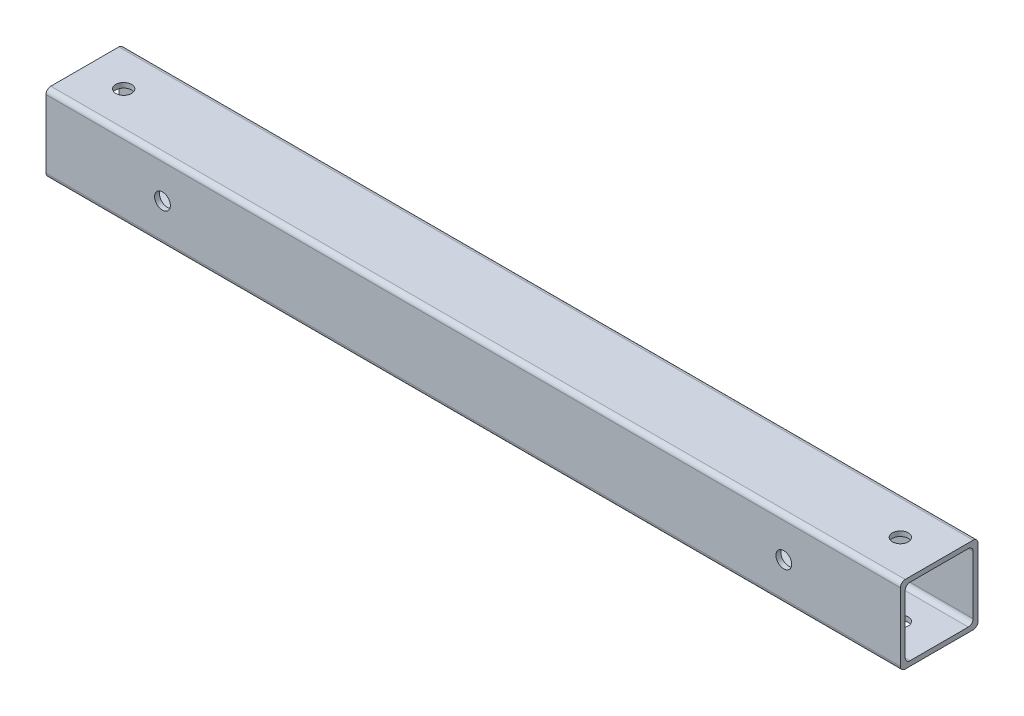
from build123d import *

# Parameters (mm, degrees)
SKETCH1_W          = 1117.6
SKETCH1_H          = 101.6
EXTRUDE1_DEPTH     = 101.6
CUT_EXTRUDE1_REACH = 1128.799
SKETCH2_W          = 88.9
SKETCH2_H          = 88.9
FILLET1_R          = 6.35
SKETCH3_R          = 10.31875
CUT_EXTRUDE2_DEPTH = 101.6
SKETCH4_R          = 10.31875
CUT_EXTRUDE3_DEPTH = 101.6


with BuildPart() as part:
    # Sketch1 → Extrude1 (new body)
    with BuildSketch(Plane(origin=(0, 0, 0), x_dir=(1, 0, 0), z_dir=(0, 1, 0))):
        with Locations((-558.8, -50.8)):
            Rectangle(SKETCH1_W, SKETCH1_H)
    extrude(amount=EXTRUDE1_DEPTH)

    # Sketch2 → Cut-Extrude1 (cut, up to next)
    with BuildSketch(Plane.ZY.offset(1117.6), mode=Mode.PRIVATE) as cut_extrude1_sk1:
        with Locations((50.8, 50.8)):
            Rectangle(SKETCH2_W, SKETCH2_H)
    cut_extrude1_tool1 = extrude(cut_extrude1_sk1.sketch, amount=-CUT_EXTRUDE1_REACH, mode=Mode.PRIVATE) & part.part
    add(cut_extrude1_tool1.solids().sort_by_distance((-1117.6, 50.8, 50.8))[0], mode=Mode.SUBTRACT)

    # Fillet1
    fillet1_edges = [part.edges().sort_by_distance(p)[0] for p in [
        (-558.8, 101.6, 101.6),
        (-558.8, 6.35, 6.35),
        (-558.8, 95.25, 6.35),
        (-558.8, 95.25, 95.25),
        (-558.8, 6.35, 95.25),
        (-558.8, 0, 101.6),
        (-558.8, 0, 0),
        (-558.8, 101.6, 0),
    ]]
    fillet(fillet1_edges, radius=FILLET1_R)

    # Sketch3 → Cut-Extrude2 (cut)
    with BuildSketch(Plane(origin=(0, 101.6, 0), x_dir=(1, 0, 0), z_dir=(0, 1, 0))):
        with Locations(Location((-1066.8, -50.8, 0), (0, 0, 270))):
            Circle(SKETCH3_R)
    cut_extrude2 = extrude(amount=-CUT_EXTRUDE2_DEPTH, mode=Mode.SUBTRACT)

    # Sketch4 → Cut-Extrude3 (cut)
    with BuildSketch(Plane.XY.offset(101.6)):
        with Locations((-965.2, 50.8)):
            Circle(SKETCH4_R)
    cut_extrude3 = extrude(amount=-CUT_EXTRUDE3_DEPTH, mode=Mode.SUBTRACT)

    # Mirror1: Cut-Extrude2, Cut-Extrude3 across plane
    add(cut_extrude2.mirror(Plane(origin=(-558.8, 0, 0), x_dir=(0, 0, 1), z_dir=(1, 0, 0))), mode=Mode.SUBTRACT)
    add(cut_extrude3.mirror(Plane(origin=(-558.8, 0, 0), x_dir=(0, 0, 1), z_dir=(1, 0, 0))), mode=Mode.SUBTRACT)


solid = part.part
